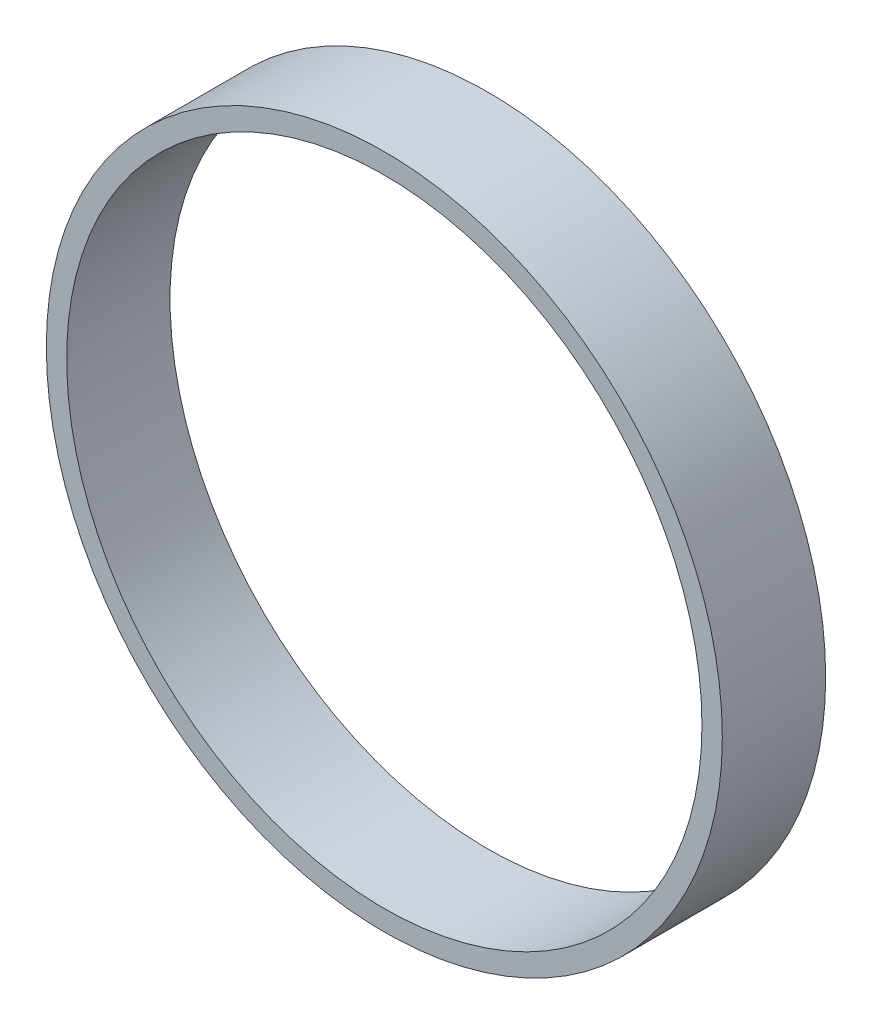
ISO-10303-21;
HEADER;
FILE_DESCRIPTION(('STEP AP214'),'2;1');
FILE_NAME('part.step','',(''),(''),'','','');
FILE_SCHEMA(('AUTOMOTIVE_DESIGN { 1 0 10303 214 1 1 1 1 }'));
ENDSEC;
DATA;
#1=APPLICATION_CONTEXT('core data for automotive mechanical design processes');
#2=APPLICATION_PROTOCOL_DEFINITION('international standard','automotive_design',2000,#1);
#3=PRODUCT_CONTEXT('',#1,'mechanical');
#4=PRODUCT('Part','Part','',(#3));
#5=PRODUCT_RELATED_PRODUCT_CATEGORY('part','',(#4));
#6=PRODUCT_DEFINITION_FORMATION('','',#4);
#7=PRODUCT_DEFINITION_CONTEXT('part definition',#1,'design');
#8=PRODUCT_DEFINITION('design','',#6,#7);
#9=PRODUCT_DEFINITION_SHAPE('','',#8);
#10=(LENGTH_UNIT() NAMED_UNIT(*) SI_UNIT(.MILLI.,.METRE.));
#11=(NAMED_UNIT(*) PLANE_ANGLE_UNIT() SI_UNIT($,.RADIAN.));
#12=(NAMED_UNIT(*) SI_UNIT($,.STERADIAN.) SOLID_ANGLE_UNIT());
#13=UNCERTAINTY_MEASURE_WITH_UNIT(LENGTH_MEASURE(1.E-05),#10,'distance_accuracy_value','');
#14=(GEOMETRIC_REPRESENTATION_CONTEXT(3) GLOBAL_UNCERTAINTY_ASSIGNED_CONTEXT((#13)) GLOBAL_UNIT_ASSIGNED_CONTEXT((#10,
#11,#12)) REPRESENTATION_CONTEXT('',''));
#15=CARTESIAN_POINT('',(0.,0.,0.));
#16=DIRECTION('',(0.,0.,1.));
#17=DIRECTION('',(1.,0.,0.));
#18=AXIS2_PLACEMENT_3D('',#15,#16,#17);
#19=CARTESIAN_POINT('',(0.,0.,12.7));
#20=DIRECTION('',(0.,0.,1.));
#21=DIRECTION('',(1.,0.,0.));
#22=AXIS2_PLACEMENT_3D('',#19,#20,#21);
#23=PLANE('',#22);
#24=CARTESIAN_POINT('',(0.,0.,12.7));
#25=DIRECTION('',(0.,0.,1.));
#26=DIRECTION('',(1.,0.,0.));
#27=AXIS2_PLACEMENT_3D('',#24,#25,#26);
#28=CIRCLE('',#27,83.05);
#29=CARTESIAN_POINT('',(83.05,0.,12.7));
#30=VERTEX_POINT('',#29);
#31=EDGE_CURVE('E10',#30,#30,#28,.T.);
#32=ORIENTED_EDGE('',*,*,#31,.T.);
#33=EDGE_LOOP('',(#32));
#34=FACE_BOUND('',#33,.T.);
#35=CARTESIAN_POINT('',(0.,0.,12.7));
#36=DIRECTION('',(0.,0.,1.));
#37=DIRECTION('',(1.,0.,0.));
#38=AXIS2_PLACEMENT_3D('',#35,#36,#37);
#39=CIRCLE('',#38,78.05);
#40=CARTESIAN_POINT('',(78.05,0.,12.7));
#41=VERTEX_POINT('',#40);
#42=EDGE_CURVE('E42',#41,#41,#39,.T.);
#43=ORIENTED_EDGE('',*,*,#42,.F.);
#44=EDGE_LOOP('',(#43));
#45=FACE_BOUND('',#44,.T.);
#46=ADVANCED_FACE('F31',(#34,#45),#23,.T.);
#47=CARTESIAN_POINT('',(0.,0.,-12.7));
#48=DIRECTION('',(0.,0.,1.));
#49=DIRECTION('',(1.,0.,0.));
#50=AXIS2_PLACEMENT_3D('',#47,#48,#49);
#51=PLANE('',#50);
#52=CARTESIAN_POINT('',(0.,0.,-12.7));
#53=DIRECTION('',(0.,0.,1.));
#54=DIRECTION('',(1.,0.,0.));
#55=AXIS2_PLACEMENT_3D('',#52,#53,#54);
#56=CIRCLE('',#55,83.05);
#57=CARTESIAN_POINT('',(83.05,0.,-12.7));
#58=VERTEX_POINT('',#57);
#59=EDGE_CURVE('E35',#58,#58,#56,.T.);
#60=ORIENTED_EDGE('',*,*,#59,.F.);
#61=EDGE_LOOP('',(#60));
#62=FACE_BOUND('',#61,.T.);
#63=CARTESIAN_POINT('',(0.,0.,-12.7));
#64=DIRECTION('',(0.,0.,1.));
#65=DIRECTION('',(1.,0.,0.));
#66=AXIS2_PLACEMENT_3D('',#63,#64,#65);
#67=CIRCLE('',#66,78.05);
#68=CARTESIAN_POINT('',(78.05,0.,-12.7));
#69=VERTEX_POINT('',#68);
#70=EDGE_CURVE('E44',#69,#69,#67,.T.);
#71=ORIENTED_EDGE('',*,*,#70,.T.);
#72=EDGE_LOOP('',(#71));
#73=FACE_BOUND('',#72,.T.);
#74=ADVANCED_FACE('F54',(#62,#73),#51,.F.);
#75=CARTESIAN_POINT('',(0.,0.,12.7));
#76=DIRECTION('',(0.,0.,-1.));
#77=DIRECTION('',(-1.,0.,0.));
#78=AXIS2_PLACEMENT_3D('',#75,#76,#77);
#79=CYLINDRICAL_SURFACE('',#78,83.05);
#80=ORIENTED_EDGE('',*,*,#31,.F.);
#81=EDGE_LOOP('',(#80));
#82=FACE_BOUND('',#81,.T.);
#83=ORIENTED_EDGE('',*,*,#59,.T.);
#84=EDGE_LOOP('',(#83));
#85=FACE_BOUND('',#84,.T.);
#86=ADVANCED_FACE('F33',(#82,#85),#79,.T.);
#87=CARTESIAN_POINT('',(0.,0.,12.7));
#88=DIRECTION('',(0.,0.,-1.));
#89=DIRECTION('',(-1.,0.,0.));
#90=AXIS2_PLACEMENT_3D('',#87,#88,#89);
#91=CYLINDRICAL_SURFACE('',#90,78.05);
#92=ORIENTED_EDGE('',*,*,#42,.T.);
#93=EDGE_LOOP('',(#92));
#94=FACE_BOUND('',#93,.T.);
#95=ORIENTED_EDGE('',*,*,#70,.F.);
#96=EDGE_LOOP('',(#95));
#97=FACE_BOUND('',#96,.T.);
#98=ADVANCED_FACE('F50',(#94,#97),#91,.F.);
#99=CLOSED_SHELL('',(#46,#74,#86,#98));
#100=MANIFOLD_SOLID_BREP('B2',#99);
#101=ADVANCED_BREP_SHAPE_REPRESENTATION('',(#18,#100),#14);
#102=SHAPE_DEFINITION_REPRESENTATION(#9,#101);
ENDSEC;
END-ISO-10303-21;
